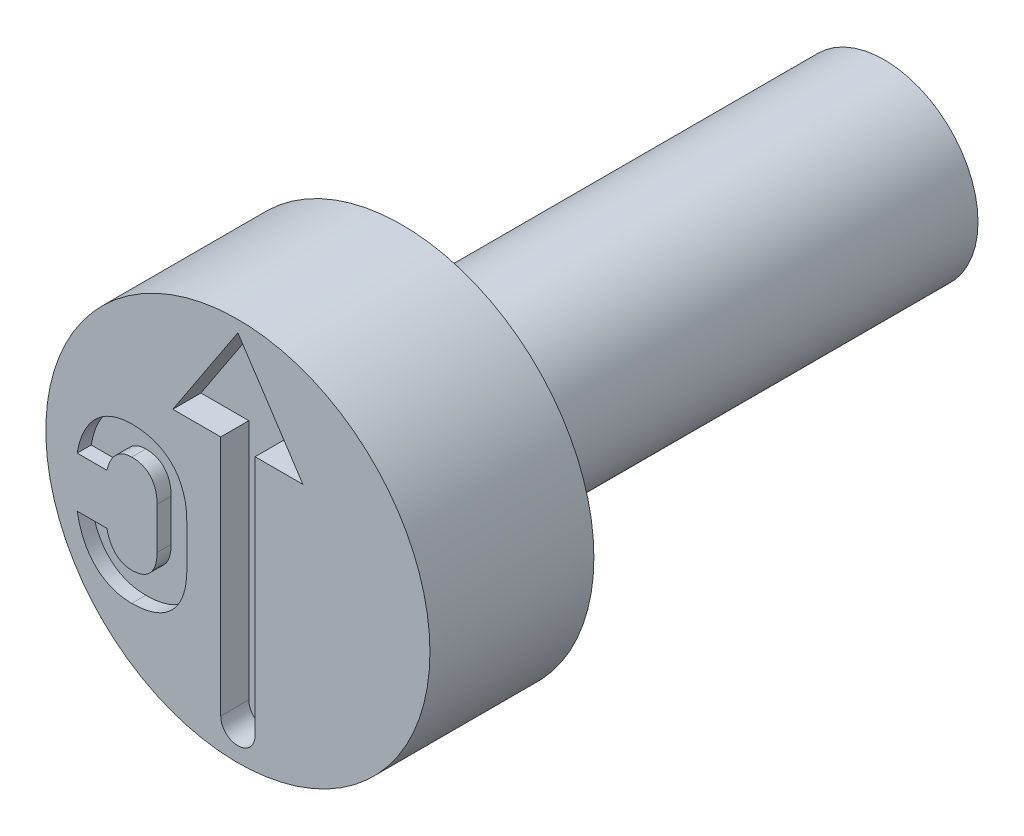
from build123d import *

# Parameters (mm, degrees)
CUT_EXTRUDE4_DEPTH = 0.6
CUT_EXTRUDE5_DEPTH = 0.3


with BuildPart() as part:
    # Sketch2 → Revolve1 (revolve)
    with BuildSketch(Plane(origin=(0, 0, 0), x_dir=(0, 0, -1), z_dir=(1, 0, 0)), mode=Mode.PRIVATE) as revolve1_sk:
        Polygon((0, 4.1), (0, 0), (13.8, 0), (13.8, 2), (3.5, 2), (3.5, 4.1), align=None)
    revolve(revolve1_sk.sketch.rotate(Axis((0, 0, -0.403888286), (0, 0, -1)), 90), axis=Axis((0, 0, -0.403888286), (0, 0, -1)))

    # Sketch3 → Cut-Extrude4 (cut)
    with BuildSketch(Plane.XY):
        with BuildLine():
            Line((0.366422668, 1.743593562), (0.366422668, -3.416891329))
            ThreePointArc((0.366422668, -3.416891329), (0, -3.783313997), (-0.366422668, -3.416891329))
            Line((-0.366422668, -3.416891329), (-0.366422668, 1.743593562))
            Line((-0.366422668, 1.743593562), (-1.388789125, 1.743593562))
            Line((-1.388789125, 1.743593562), (0, 3.851569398))
            Line((0, 3.851569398), (1.388789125, 1.743593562))
            Line((1.388789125, 1.743593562), (0.366422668, 1.743593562))
        make_face()
    extrude(amount=-CUT_EXTRUDE4_DEPTH, mode=Mode.SUBTRACT)

    # Sketch4 → Cut-Extrude5 (cut)
    with BuildSketch(Plane.XY):
        with BuildLine():
            add(Edge.make_bspline(
                [(-2.266374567, -2.283778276), (-2.236116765, -2.283450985), (-2.176408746, -2.282805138), (-2.088612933, -2.276084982), (-2.00391148, -2.264851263), (-1.922766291, -2.249009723), (-1.844953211, -2.229025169), (-1.770139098, -2.205403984), (-1.699043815, -2.176162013), (-1.630977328, -2.143001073), (-1.566898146, -2.105468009), (-1.506942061, -2.063251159), (-1.450514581, -2.017675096), (-1.398043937, -1.967825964), (-1.349584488, -1.913995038), (-1.304860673, -1.856122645), (-1.264791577, -1.793839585), (-1.228136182, -1.727985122), (-1.195524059, -1.658379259), (-1.16799907, -1.584689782), (-1.14413514, -1.507730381), (-1.124172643, -1.427513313), (-1.108888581, -1.34367397), (-1.098700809, -1.256275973), (-1.0916384, -1.165237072), (-1.091055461, -1.103318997), (-1.090758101, -1.071734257)],
                knots=[0, 0, 0, 0, 1.134237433, 2.238201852, 3.298772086, 4.336057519, 5.335809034, 6.309558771, 7.274828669, 8.21507465, 9.146315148, 10.055631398, 10.961815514, 11.863452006, 12.765999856, 13.674901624, 14.60241943, 15.539819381, 16.498894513, 17.481225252, 18.486546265, 19.518401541, 20.578551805, 21.679128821, 22.816111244, 24, 24, 24, 24], degree=3))
            Line((-1.090758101, -1.071734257), (-1.090758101, -0.1802527))
            add(Edge.make_bspline(
                [(-1.090758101, -0.1802527), (-1.091055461, -0.14866796), (-1.091638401, -0.086749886), (-1.098700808, 0.004289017), (-1.108888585, 0.091687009), (-1.124172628, 0.175526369), (-1.144135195, 0.255743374), (-1.167998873, 0.332703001), (-1.195524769, 0.406391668), (-1.228133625, 0.476000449), (-1.264800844, 0.541844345), (-1.304826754, 0.604166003), (-1.349808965, 0.662027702), (-1.397808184, 0.716491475), (-1.450544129, 0.766326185), (-1.506940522, 0.811919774), (-1.566874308, 0.854195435), (-1.63116216, 0.891517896), (-1.698836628, 0.925717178), (-1.770300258, 0.954495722), (-1.844806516, 0.979247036), (-1.922788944, 0.998942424), (-2.003905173, 1.014870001), (-2.088614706, 1.026079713), (-2.176408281, 1.03280652), (-2.236116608, 1.03345145), (-2.266374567, 1.033778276)],
                knots=[0, 0, 0, 0, 1.183277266, 2.319672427, 3.419680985, 4.479283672, 5.510605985, 6.515407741, 7.497231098, 8.455810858, 9.392726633, 10.319765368, 11.22819768, 12.136441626, 13.037612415, 13.943328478, 14.852175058, 15.782934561, 16.726365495, 17.691136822, 18.666946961, 19.666182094, 20.70293176, 21.7629542, 22.866348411, 24, 24, 24, 24], degree=3))
            add(Edge.make_bspline(
                [(-2.266374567, 1.033778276), (-2.316167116, 1.032445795), (-2.413772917, 1.029833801), (-2.555635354, 1.003607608), (-2.689599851, 0.962776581), (-2.814883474, 0.904555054), (-2.931094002, 0.831097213), (-3.036870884, 0.741721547), (-3.132178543, 0.637598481), (-3.216194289, 0.518302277), (-3.289157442, 0.385497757), (-3.349223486, 0.2391688), (-3.397979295, 0.080406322), (-3.419619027, -0.030986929), (-3.430731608, -0.08819034)],
                knots=[0, 0, 0, 0, 1.00806925, 1.976066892, 2.912865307, 3.839664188, 4.766819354, 5.690806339, 6.637604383, 7.619531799, 8.640729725, 9.701744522, 10.819784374, 12, 12, 12, 12], degree=3))
            Line((-3.430731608, -0.08819034), (-2.796229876, -0.08819034))
            add(Edge.make_bspline(
                [(-2.796229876, -0.08819034), (-2.789829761, -0.062229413), (-2.77737572, -0.011711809), (-2.751733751, 0.060153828), (-2.722576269, 0.126720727), (-2.686916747, 0.186402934), (-2.648097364, 0.240641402), (-2.604318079, 0.287631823), (-2.556537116, 0.328153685), (-2.505123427, 0.361668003), (-2.450217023, 0.388981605), (-2.391568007, 0.407057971), (-2.329986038, 0.418861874), (-2.287845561, 0.420366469), (-2.266374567, 0.421133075)],
                knots=[0, 0, 0, 0, 1.203096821, 2.341117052, 3.431111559, 4.469295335, 5.465369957, 6.42892467, 7.35290722, 8.279239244, 9.186115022, 10.104036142, 11.033987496, 12, 12, 12, 12], degree=3))
            add(Edge.make_bspline(
                [(-2.266374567, 0.421133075), (-2.238739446, 0.420165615), (-2.185375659, 0.418297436), (-2.108068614, 0.406126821), (-2.037650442, 0.383199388), (-1.97313766, 0.352783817), (-1.915507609, 0.313389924), (-1.865378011, 0.265096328), (-1.822723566, 0.208558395), (-1.786781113, 0.144749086), (-1.758989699, 0.073127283), (-1.739435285, -0.00542336), (-1.727334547, -0.090685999), (-1.725966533, -0.149744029), (-1.725259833, -0.1802527)],
                knots=[0, 0, 0, 0, 1.082677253, 2.090664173, 3.053339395, 3.973921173, 4.875832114, 5.774919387, 6.688160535, 7.640683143, 8.634736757, 9.687648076, 10.805466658, 12, 12, 12, 12], degree=3))
            Line((-1.725259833, -0.1802527), (-1.725259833, -1.071734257))
            add(Edge.make_bspline(
                [(-1.725259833, -1.071734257), (-1.725973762, -1.102240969), (-1.727355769, -1.161295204), (-1.739328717, -1.246372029), (-1.759137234, -1.324629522), (-1.786619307, -1.395934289), (-1.822718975, -1.459268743), (-1.865589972, -1.51514448), (-1.915479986, -1.563426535), (-1.97316341, -1.602710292), (-2.037512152, -1.633438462), (-2.108279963, -1.655038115), (-2.185278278, -1.668596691), (-2.238718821, -1.670268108), (-2.266374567, -1.671133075)],
                knots=[0, 0, 0, 0, 1.196920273, 2.316972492, 3.363591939, 4.359631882, 5.306515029, 6.214703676, 7.115587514, 8.019300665, 8.94172196, 9.903709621, 10.915159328, 12, 12, 12, 12], degree=3))
            add(Edge.make_bspline(
                [(-2.266374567, -1.671133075), (-2.288265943, -1.670270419), (-2.331203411, -1.668578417), (-2.393930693, -1.65822035), (-2.45299044, -1.639130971), (-2.508781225, -1.613410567), (-2.560894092, -1.580180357), (-2.607843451, -1.539122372), (-2.651574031, -1.492386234), (-2.690495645, -1.438450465), (-2.724998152, -1.37809339), (-2.753851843, -1.311291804), (-2.778897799, -1.238789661), (-2.790334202, -1.18755813), (-2.796229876, -1.161147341)],
                knots=[0, 0, 0, 0, 0.981077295, 1.924272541, 2.837745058, 3.753838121, 4.670304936, 5.59622504, 6.54113043, 7.532377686, 8.569122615, 9.649813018, 10.788435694, 12, 12, 12, 12], degree=3))
            Line((-2.796229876, -1.161147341), (-3.430731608, -1.161147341))
            add(Edge.make_bspline(
                [(-3.430731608, -1.161147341), (-3.419412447, -1.218576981), (-3.397405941, -1.330230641), (-3.347953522, -1.489233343), (-3.287011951, -1.635321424), (-3.21448808, -1.76827576), (-3.12993977, -1.886781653), (-3.035389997, -1.991282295), (-2.930039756, -2.080895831), (-2.81410575, -2.154721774), (-2.688924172, -2.212760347), (-2.555180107, -2.253519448), (-2.413562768, -2.279888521), (-2.316169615, -2.282462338), (-2.266374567, -2.283778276)],
                knots=[0, 0, 0, 0, 1.185884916, 2.305575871, 3.368634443, 4.390138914, 5.368714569, 6.312778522, 7.23993122, 8.163588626, 9.090665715, 10.027745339, 10.991628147, 12, 12, 12, 12], degree=3))
        make_face()
    extrude(amount=-CUT_EXTRUDE5_DEPTH, mode=Mode.SUBTRACT)


solid = part.part
